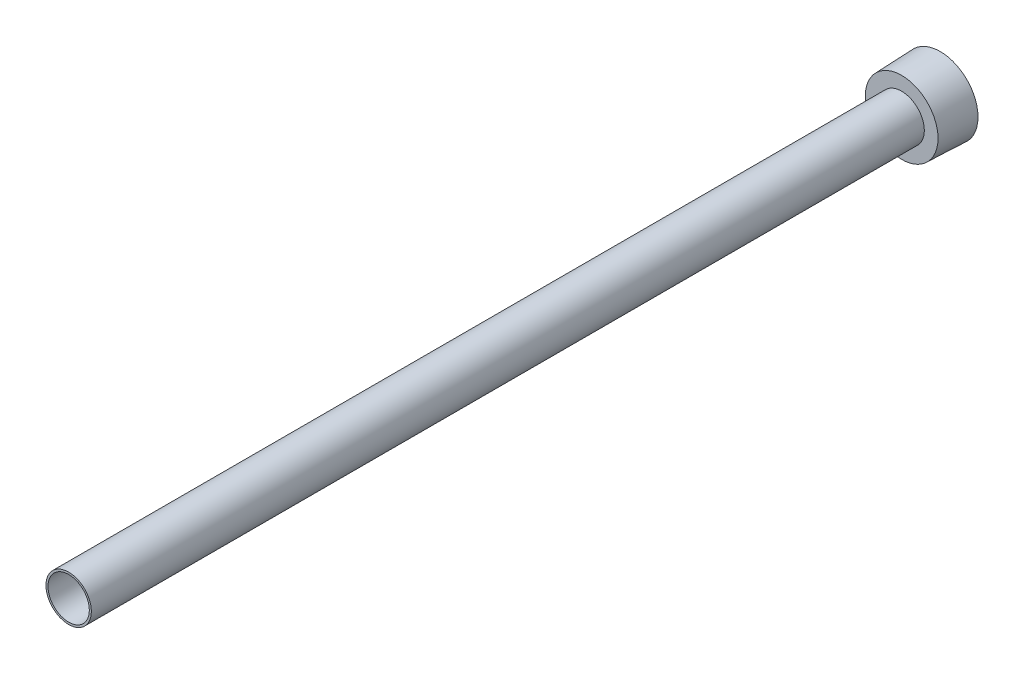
from build123d import *

# Parameters (mm, degrees)
SKETCH2_R          = 7.2263
CUT_EXTRUDE1_DEPTH = 306.372909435
CUT_EXTRUDE2_DEPTH = 9.525


with BuildPart() as part:
    # Sketch1 → Revolve1 (revolve)
    with BuildSketch(Plane(origin=(0, 0, 0), x_dir=(0, 0, -1), z_dir=(1, 0, 0)), mode=Mode.PRIVATE) as revolve1_sk:
        Polygon((-304.8, 0), (0, 0), (0, 13.2207), (-13.4874, 12.728732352), (-13.4874, 7.9375), (-304.8, 7.9375), align=None)
    revolve(revolve1_sk.sketch.rotate(Axis((0, 0, 278.001114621), (0, 0, -1)), 90), axis=Axis((0, 0, 278.001114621), (0, 0, -1)))

    # Sketch2 → Cut-Extrude1 (cut, through all)
    with BuildSketch(Plane.XY.offset(304.8)):
        Circle(SKETCH2_R)
    extrude(amount=-CUT_EXTRUDE1_DEPTH, mode=Mode.SUBTRACT)

    # Sketch3 → Cut-Extrude2 (cut)
    with BuildSketch(Plane(origin=(0, 0, 0), x_dir=(-1, 0, 0), z_dir=(0, 0, -1))):
        Polygon((-9.525, -5.499261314), (0, -10.998522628), (9.525, -5.499261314), (9.525, 5.499261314), (0, 10.998522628), (-9.525, 5.499261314), align=None)
    extrude(amount=-CUT_EXTRUDE2_DEPTH, mode=Mode.SUBTRACT)


solid = part.part
